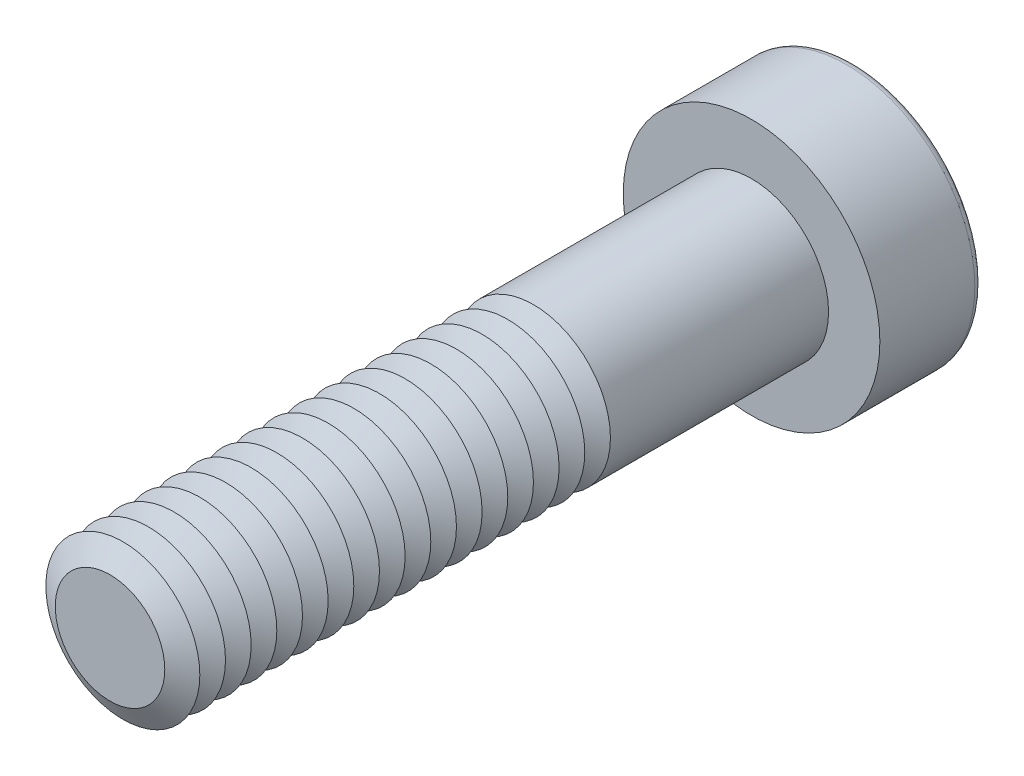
from build123d import *

# Parameters (mm, degrees)
SKETCH1_R           = 3
BOSS_EXTRUDE1_DEPTH = 25
SKETCH2_R           = 5
BOSS_EXTRUDE2_DEPTH = 4
CUT_EXTRUDE1_DEPTH  = 3
FILLET1_R           = 0.3
LPATTERN1_COUNT     = 17
LPATTERN1_PITCH     = 1


with BuildPart() as part:
    # Sketch1 → Boss-Extrude1 (new body)
    with BuildSketch(Plane.XY):
        Circle(SKETCH1_R)
    extrude(amount=BOSS_EXTRUDE1_DEPTH)

    # Sketch2 → Boss-Extrude2 (add)
    with BuildSketch(Plane(origin=(0, 0, 0), x_dir=(-1, 0, 0), z_dir=(0, 0, -1))):
        Circle(SKETCH2_R)
    extrude(amount=BOSS_EXTRUDE2_DEPTH)

    # Sketch3 → Cut-Extrude1 (cut)
    with BuildSketch(Plane(origin=(0, 0, -4), x_dir=(-1, 0, 0), z_dir=(0, 0, -1))):
        Polygon((-1.154700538, 2), (-2.309401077, 0), (-1.154700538, -2), (1.154700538, -2), (2.309401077, 0), (1.154700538, 2), align=None)
    extrude(amount=-CUT_EXTRUDE1_DEPTH, mode=Mode.SUBTRACT)

    # Fillet1
    fillet1_edges = [part.edges().sort_by_distance(p)[0] for p in [
        (5, 0, -4),
    ]]
    fillet(fillet1_edges, radius=FILLET1_R)

    # Cut-Extrude2 cone 1 section (on through the dimple's axis) → Cut-Extrude2 (revolve, cut)
    with BuildSketch(Plane(origin=(0, 0, -1), x_dir=(0, 1, 0), z_dir=(1, 0, 0))):
        Polygon((0, 0), (2, 0), (0, 1.154700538), align=None)
    revolve(axis=Axis((0, 0, -1), (0, 0, 1)), mode=Mode.SUBTRACT)

    # Cut-Extrude3 cone 1 section (on through the dimple's axis) → Cut-Extrude3 (revolve, cut)
    with BuildSketch(Plane(origin=(0, 0, -4), x_dir=(0, 1, 0), z_dir=(1, 0, 0))):
        Polygon((0, 0), (2.309401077, 0), (0, 0.618802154), align=None)
    revolve(axis=Axis((0, 0, -4), (0, 0, 1)), mode=Mode.SUBTRACT)

    # Sketch7 → Cut-Revolve1 (revolve, cut)
    with BuildSketch(Plane(origin=(0, 0, 0), x_dir=(0, 0, -1), z_dir=(1, 0, 0)), mode=Mode.PRIVATE) as cut_revolve1_sk:
        Polygon((-25, 2.133974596), (-24.5, 3), (-25.5, 3), align=None)
    cut_revolve1 = revolve(cut_revolve1_sk.sketch.rotate(Axis((0, 0, 25), (0, 0, -1)), 90), axis=Axis((0, 0, 25), (0, 0, -1)), mode=Mode.SUBTRACT)

    # LPattern1: Cut-Revolve1 ×17
    with Locations(*[(0, 0, -i * LPATTERN1_PITCH) for i in range(1, LPATTERN1_COUNT)]):
        add(cut_revolve1, mode=Mode.SUBTRACT)


solid = part.part
